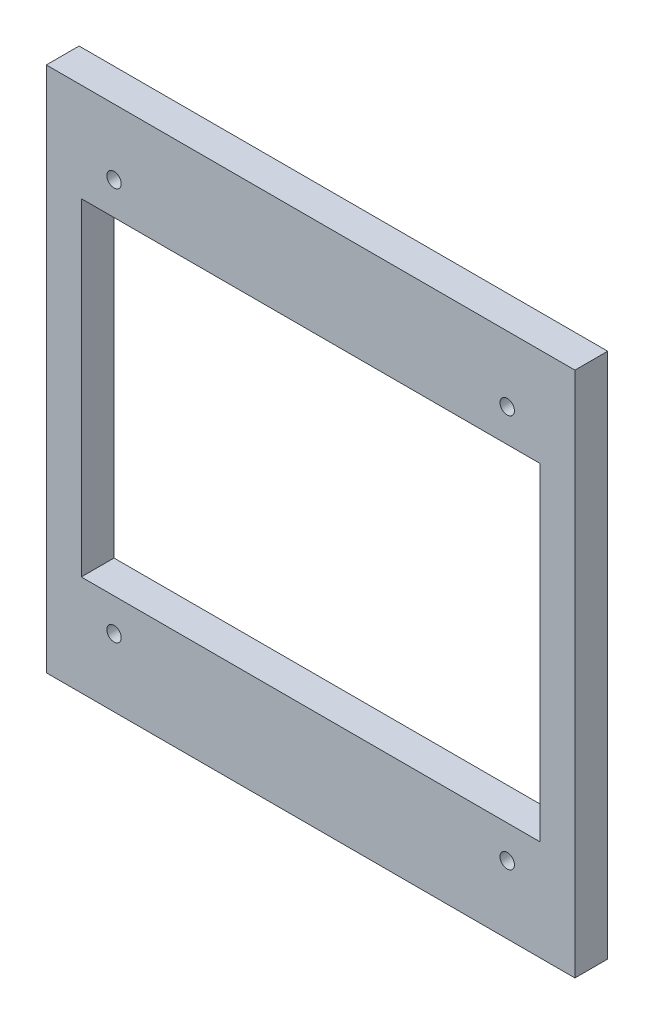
ISO-10303-21;
HEADER;
FILE_DESCRIPTION(('STEP AP214'),'2;1');
FILE_NAME('part.step','',(''),(''),'','','');
FILE_SCHEMA(('AUTOMOTIVE_DESIGN { 1 0 10303 214 1 1 1 1 }'));
ENDSEC;
DATA;
#1=APPLICATION_CONTEXT('core data for automotive mechanical design processes');
#2=APPLICATION_PROTOCOL_DEFINITION('international standard','automotive_design',2000,#1);
#3=PRODUCT_CONTEXT('',#1,'mechanical');
#4=PRODUCT('Part','Part','',(#3));
#5=PRODUCT_RELATED_PRODUCT_CATEGORY('part','',(#4));
#6=PRODUCT_DEFINITION_FORMATION('','',#4);
#7=PRODUCT_DEFINITION_CONTEXT('part definition',#1,'design');
#8=PRODUCT_DEFINITION('design','',#6,#7);
#9=PRODUCT_DEFINITION_SHAPE('','',#8);
#10=(LENGTH_UNIT() NAMED_UNIT(*) SI_UNIT(.MILLI.,.METRE.));
#11=(NAMED_UNIT(*) PLANE_ANGLE_UNIT() SI_UNIT($,.RADIAN.));
#12=(NAMED_UNIT(*) SI_UNIT($,.STERADIAN.) SOLID_ANGLE_UNIT());
#13=UNCERTAINTY_MEASURE_WITH_UNIT(LENGTH_MEASURE(1.E-05),#10,'distance_accuracy_value','');
#14=(GEOMETRIC_REPRESENTATION_CONTEXT(3) GLOBAL_UNCERTAINTY_ASSIGNED_CONTEXT((#13)) GLOBAL_UNIT_ASSIGNED_CONTEXT((#10,
#11,#12)) REPRESENTATION_CONTEXT('',''));
#15=CARTESIAN_POINT('',(0.,0.,0.));
#16=DIRECTION('',(0.,0.,1.));
#17=DIRECTION('',(1.,0.,0.));
#18=AXIS2_PLACEMENT_3D('',#15,#16,#17);
#19=CARTESIAN_POINT('',(-2.53999999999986,609.599999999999,38.1));
#20=DIRECTION('',(0.,0.,-1.));
#21=DIRECTION('',(-1.,0.,0.));
#22=AXIS2_PLACEMENT_3D('',#19,#20,#21);
#23=PLANE('',#22);
#24=CARTESIAN_POINT('',(533.4,533.4,38.1));
#25=DIRECTION('',(0.,0.,-1.));
#26=DIRECTION('',(-1.,0.,0.));
#27=AXIS2_PLACEMENT_3D('',#24,#25,#26);
#28=CIRCLE('',#27,8.38199999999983);
#29=CARTESIAN_POINT('',(525.018,533.4,38.1));
#30=VERTEX_POINT('',#29);
#31=EDGE_CURVE('E241',#30,#30,#28,.T.);
#32=ORIENTED_EDGE('',*,*,#31,.T.);
#33=EDGE_LOOP('',(#32));
#34=FACE_BOUND('',#33,.T.);
#35=CARTESIAN_POINT('',(76.1999999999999,533.4,38.1));
#36=DIRECTION('',(0.,0.,-1.));
#37=DIRECTION('',(-1.,0.,0.));
#38=AXIS2_PLACEMENT_3D('',#35,#36,#37);
#39=CIRCLE('',#38,8.38199999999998);
#40=CARTESIAN_POINT('',(67.8179999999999,533.4,38.1));
#41=VERTEX_POINT('',#40);
#42=EDGE_CURVE('E251',#41,#41,#39,.T.);
#43=ORIENTED_EDGE('',*,*,#42,.T.);
#44=EDGE_LOOP('',(#43));
#45=FACE_BOUND('',#44,.T.);
#46=CARTESIAN_POINT('',(533.4,76.2,38.1));
#47=DIRECTION('',(0.,0.,-1.));
#48=DIRECTION('',(-1.,0.,0.));
#49=AXIS2_PLACEMENT_3D('',#46,#47,#48);
#50=CIRCLE('',#49,8.38199999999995);
#51=CARTESIAN_POINT('',(525.018,76.2,38.1));
#52=VERTEX_POINT('',#51);
#53=EDGE_CURVE('E259',#52,#52,#50,.T.);
#54=ORIENTED_EDGE('',*,*,#53,.T.);
#55=EDGE_LOOP('',(#54));
#56=FACE_BOUND('',#55,.T.);
#57=CARTESIAN_POINT('',(76.2000000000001,76.2,38.1));
#58=DIRECTION('',(0.,0.,-1.));
#59=DIRECTION('',(-1.,0.,0.));
#60=AXIS2_PLACEMENT_3D('',#57,#58,#59);
#61=CIRCLE('',#60,8.382);
#62=CARTESIAN_POINT('',(67.8180000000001,76.2,38.1));
#63=VERTEX_POINT('',#62);
#64=EDGE_CURVE('E138',#63,#63,#61,.T.);
#65=ORIENTED_EDGE('',*,*,#64,.T.);
#66=EDGE_LOOP('',(#65));
#67=FACE_BOUND('',#66,.T.);
#68=DIRECTION('',(0.,-1.,0.));
#69=VECTOR('',#68,1.);
#70=CARTESIAN_POINT('',(-2.53999999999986,-2.54,38.1));
#71=LINE('',#70,#69);
#72=CARTESIAN_POINT('',(-2.53999999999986,609.599999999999,38.1));
#73=VERTEX_POINT('',#72);
#74=CARTESIAN_POINT('',(-2.53999999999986,-2.54,38.1));
#75=VERTEX_POINT('',#74);
#76=EDGE_CURVE('E148',#73,#75,#71,.T.);
#77=ORIENTED_EDGE('',*,*,#76,.T.);
#78=DIRECTION('',(1.,0.,0.));
#79=VECTOR('',#78,1.);
#80=CARTESIAN_POINT('',(-2.53999999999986,-2.54,38.1));
#81=LINE('',#80,#79);
#82=CARTESIAN_POINT('',(612.14,-2.54,38.1));
#83=VERTEX_POINT('',#82);
#84=EDGE_CURVE('E149',#75,#83,#81,.T.);
#85=ORIENTED_EDGE('',*,*,#84,.T.);
#86=DIRECTION('',(0.,1.,0.));
#87=VECTOR('',#86,1.);
#88=CARTESIAN_POINT('',(612.14,-2.54,38.1));
#89=LINE('',#88,#87);
#90=CARTESIAN_POINT('',(612.14,609.599999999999,38.1));
#91=VERTEX_POINT('',#90);
#92=EDGE_CURVE('E155',#83,#91,#89,.T.);
#93=ORIENTED_EDGE('',*,*,#92,.T.);
#94=DIRECTION('',(-1.,0.,0.));
#95=VECTOR('',#94,1.);
#96=CARTESIAN_POINT('',(-2.53999999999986,609.599999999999,38.1));
#97=LINE('',#96,#95);
#98=EDGE_CURVE('E152',#91,#73,#97,.T.);
#99=ORIENTED_EDGE('',*,*,#98,.T.);
#100=EDGE_LOOP('',(#77,#85,#93,#99));
#101=FACE_BOUND('',#100,.T.);
#102=DIRECTION('',(0.,1.,0.));
#103=VECTOR('',#102,1.);
#104=CARTESIAN_POINT('',(571.5,495.3,38.1));
#105=LINE('',#104,#103);
#106=CARTESIAN_POINT('',(571.5,114.3,38.1));
#107=VERTEX_POINT('',#106);
#108=CARTESIAN_POINT('',(571.5,495.3,38.1));
#109=VERTEX_POINT('',#108);
#110=EDGE_CURVE('E107',#107,#109,#105,.T.);
#111=ORIENTED_EDGE('',*,*,#110,.F.);
#112=DIRECTION('',(1.,0.,0.));
#113=VECTOR('',#112,1.);
#114=CARTESIAN_POINT('',(571.5,114.3,38.1));
#115=LINE('',#114,#113);
#116=CARTESIAN_POINT('',(38.1000000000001,114.3,38.1));
#117=VERTEX_POINT('',#116);
#118=EDGE_CURVE('E128',#117,#107,#115,.T.);
#119=ORIENTED_EDGE('',*,*,#118,.F.);
#120=DIRECTION('',(0.,-1.,0.));
#121=VECTOR('',#120,1.);
#122=CARTESIAN_POINT('',(38.1000000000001,495.3,38.1));
#123=LINE('',#122,#121);
#124=CARTESIAN_POINT('',(38.1000000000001,495.3,38.1));
#125=VERTEX_POINT('',#124);
#126=EDGE_CURVE('E126',#125,#117,#123,.T.);
#127=ORIENTED_EDGE('',*,*,#126,.F.);
#128=DIRECTION('',(-1.,0.,0.));
#129=VECTOR('',#128,1.);
#130=CARTESIAN_POINT('',(571.5,495.3,38.1));
#131=LINE('',#130,#129);
#132=EDGE_CURVE('E118',#109,#125,#131,.T.);
#133=ORIENTED_EDGE('',*,*,#132,.F.);
#134=EDGE_LOOP('',(#111,#119,#127,#133));
#135=FACE_BOUND('',#134,.T.);
#136=ADVANCED_FACE('F43',(#34,#45,#56,#67,#101,#135),#23,.F.);
#137=CARTESIAN_POINT('',(-2.53999999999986,609.599999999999,0.));
#138=DIRECTION('',(0.,0.,-1.));
#139=DIRECTION('',(-1.,0.,0.));
#140=AXIS2_PLACEMENT_3D('',#137,#138,#139);
#141=PLANE('',#140);
#142=CARTESIAN_POINT('',(533.4,533.4,0.));
#143=DIRECTION('',(0.,0.,-1.));
#144=DIRECTION('',(-1.,0.,0.));
#145=AXIS2_PLACEMENT_3D('',#142,#143,#144);
#146=CIRCLE('',#145,8.38199999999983);
#147=CARTESIAN_POINT('',(525.018,533.4,0.));
#148=VERTEX_POINT('',#147);
#149=EDGE_CURVE('E246',#148,#148,#146,.T.);
#150=ORIENTED_EDGE('',*,*,#149,.F.);
#151=EDGE_LOOP('',(#150));
#152=FACE_BOUND('',#151,.T.);
#153=CARTESIAN_POINT('',(76.1999999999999,533.4,0.));
#154=DIRECTION('',(0.,0.,-1.));
#155=DIRECTION('',(-1.,0.,0.));
#156=AXIS2_PLACEMENT_3D('',#153,#154,#155);
#157=CIRCLE('',#156,8.38199999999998);
#158=CARTESIAN_POINT('',(67.8179999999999,533.4,0.));
#159=VERTEX_POINT('',#158);
#160=EDGE_CURVE('E247',#159,#159,#157,.T.);
#161=ORIENTED_EDGE('',*,*,#160,.F.);
#162=EDGE_LOOP('',(#161));
#163=FACE_BOUND('',#162,.T.);
#164=CARTESIAN_POINT('',(533.4,76.2,0.));
#165=DIRECTION('',(0.,0.,-1.));
#166=DIRECTION('',(-1.,0.,0.));
#167=AXIS2_PLACEMENT_3D('',#164,#165,#166);
#168=CIRCLE('',#167,8.38199999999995);
#169=CARTESIAN_POINT('',(525.018,76.2,0.));
#170=VERTEX_POINT('',#169);
#171=EDGE_CURVE('E258',#170,#170,#168,.T.);
#172=ORIENTED_EDGE('',*,*,#171,.F.);
#173=EDGE_LOOP('',(#172));
#174=FACE_BOUND('',#173,.T.);
#175=CARTESIAN_POINT('',(76.2000000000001,76.2,0.));
#176=DIRECTION('',(0.,0.,-1.));
#177=DIRECTION('',(-1.,0.,0.));
#178=AXIS2_PLACEMENT_3D('',#175,#176,#177);
#179=CIRCLE('',#178,8.382);
#180=CARTESIAN_POINT('',(67.8180000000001,76.2,0.));
#181=VERTEX_POINT('',#180);
#182=EDGE_CURVE('E265',#181,#181,#179,.T.);
#183=ORIENTED_EDGE('',*,*,#182,.F.);
#184=EDGE_LOOP('',(#183));
#185=FACE_BOUND('',#184,.T.);
#186=DIRECTION('',(0.,-1.,0.));
#187=VECTOR('',#186,1.);
#188=CARTESIAN_POINT('',(-2.53999999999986,-2.54,0.));
#189=LINE('',#188,#187);
#190=CARTESIAN_POINT('',(-2.53999999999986,609.599999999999,0.));
#191=VERTEX_POINT('',#190);
#192=CARTESIAN_POINT('',(-2.53999999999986,-2.54,0.));
#193=VERTEX_POINT('',#192);
#194=EDGE_CURVE('E122',#191,#193,#189,.T.);
#195=ORIENTED_EDGE('',*,*,#194,.F.);
#196=DIRECTION('',(-1.,0.,0.));
#197=VECTOR('',#196,1.);
#198=CARTESIAN_POINT('',(-2.53999999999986,609.599999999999,0.));
#199=LINE('',#198,#197);
#200=CARTESIAN_POINT('',(612.14,609.599999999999,0.));
#201=VERTEX_POINT('',#200);
#202=EDGE_CURVE('E147',#201,#191,#199,.T.);
#203=ORIENTED_EDGE('',*,*,#202,.F.);
#204=DIRECTION('',(0.,1.,0.));
#205=VECTOR('',#204,1.);
#206=CARTESIAN_POINT('',(612.14,-2.54,0.));
#207=LINE('',#206,#205);
#208=CARTESIAN_POINT('',(612.14,-2.54,0.));
#209=VERTEX_POINT('',#208);
#210=EDGE_CURVE('E161',#209,#201,#207,.T.);
#211=ORIENTED_EDGE('',*,*,#210,.F.);
#212=DIRECTION('',(1.,0.,0.));
#213=VECTOR('',#212,1.);
#214=CARTESIAN_POINT('',(-2.53999999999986,-2.54,0.));
#215=LINE('',#214,#213);
#216=EDGE_CURVE('E157',#193,#209,#215,.T.);
#217=ORIENTED_EDGE('',*,*,#216,.F.);
#218=EDGE_LOOP('',(#195,#203,#211,#217));
#219=FACE_BOUND('',#218,.T.);
#220=DIRECTION('',(1.,0.,0.));
#221=VECTOR('',#220,1.);
#222=CARTESIAN_POINT('',(571.5,114.3,0.));
#223=LINE('',#222,#221);
#224=CARTESIAN_POINT('',(38.1000000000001,114.3,0.));
#225=VERTEX_POINT('',#224);
#226=CARTESIAN_POINT('',(571.5,114.3,0.));
#227=VERTEX_POINT('',#226);
#228=EDGE_CURVE('E120',#225,#227,#223,.T.);
#229=ORIENTED_EDGE('',*,*,#228,.T.);
#230=DIRECTION('',(0.,1.,0.));
#231=VECTOR('',#230,1.);
#232=CARTESIAN_POINT('',(571.5,495.3,0.));
#233=LINE('',#232,#231);
#234=CARTESIAN_POINT('',(571.5,495.3,0.));
#235=VERTEX_POINT('',#234);
#236=EDGE_CURVE('E66',#227,#235,#233,.T.);
#237=ORIENTED_EDGE('',*,*,#236,.T.);
#238=DIRECTION('',(-1.,0.,0.));
#239=VECTOR('',#238,1.);
#240=CARTESIAN_POINT('',(571.5,495.3,0.));
#241=LINE('',#240,#239);
#242=CARTESIAN_POINT('',(38.1000000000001,495.3,0.));
#243=VERTEX_POINT('',#242);
#244=EDGE_CURVE('E123',#235,#243,#241,.T.);
#245=ORIENTED_EDGE('',*,*,#244,.T.);
#246=DIRECTION('',(0.,-1.,0.));
#247=VECTOR('',#246,1.);
#248=CARTESIAN_POINT('',(38.1000000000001,495.3,0.));
#249=LINE('',#248,#247);
#250=EDGE_CURVE('E136',#243,#225,#249,.T.);
#251=ORIENTED_EDGE('',*,*,#250,.T.);
#252=EDGE_LOOP('',(#229,#237,#245,#251));
#253=FACE_BOUND('',#252,.T.);
#254=ADVANCED_FACE('F177',(#152,#163,#174,#185,#219,#253),#141,.T.);
#255=CARTESIAN_POINT('',(-2.53999999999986,-2.54,38.1));
#256=DIRECTION('',(1.,0.,0.));
#257=DIRECTION('',(0.,0.,-1.));
#258=AXIS2_PLACEMENT_3D('',#255,#256,#257);
#259=PLANE('',#258);
#260=ORIENTED_EDGE('',*,*,#194,.T.);
#261=DIRECTION('',(0.,0.,-1.));
#262=VECTOR('',#261,1.);
#263=CARTESIAN_POINT('',(-2.53999999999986,-2.54,38.1));
#264=LINE('',#263,#262);
#265=EDGE_CURVE('E11',#75,#193,#264,.T.);
#266=ORIENTED_EDGE('',*,*,#265,.F.);
#267=ORIENTED_EDGE('',*,*,#76,.F.);
#268=DIRECTION('',(0.,0.,-1.));
#269=VECTOR('',#268,1.);
#270=CARTESIAN_POINT('',(-2.53999999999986,609.599999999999,38.1));
#271=LINE('',#270,#269);
#272=EDGE_CURVE('E156',#73,#191,#271,.T.);
#273=ORIENTED_EDGE('',*,*,#272,.T.);
#274=EDGE_LOOP('',(#260,#266,#267,#273));
#275=FACE_BOUND('',#274,.T.);
#276=ADVANCED_FACE('F44',(#275),#259,.F.);
#277=CARTESIAN_POINT('',(-2.53999999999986,-2.54,38.1));
#278=DIRECTION('',(0.,1.,0.));
#279=DIRECTION('',(0.,0.,1.));
#280=AXIS2_PLACEMENT_3D('',#277,#278,#279);
#281=PLANE('',#280);
#282=ORIENTED_EDGE('',*,*,#216,.T.);
#283=DIRECTION('',(0.,0.,-1.));
#284=VECTOR('',#283,1.);
#285=CARTESIAN_POINT('',(612.14,-2.54,38.1));
#286=LINE('',#285,#284);
#287=EDGE_CURVE('E51',#83,#209,#286,.T.);
#288=ORIENTED_EDGE('',*,*,#287,.F.);
#289=ORIENTED_EDGE('',*,*,#84,.F.);
#290=ORIENTED_EDGE('',*,*,#265,.T.);
#291=EDGE_LOOP('',(#282,#288,#289,#290));
#292=FACE_BOUND('',#291,.T.);
#293=ADVANCED_FACE('F190',(#292),#281,.F.);
#294=CARTESIAN_POINT('',(612.14,-2.54,38.1));
#295=DIRECTION('',(-1.,0.,0.));
#296=DIRECTION('',(0.,0.,1.));
#297=AXIS2_PLACEMENT_3D('',#294,#295,#296);
#298=PLANE('',#297);
#299=ORIENTED_EDGE('',*,*,#210,.T.);
#300=DIRECTION('',(0.,0.,-1.));
#301=VECTOR('',#300,1.);
#302=CARTESIAN_POINT('',(612.14,609.599999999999,38.1));
#303=LINE('',#302,#301);
#304=EDGE_CURVE('E167',#91,#201,#303,.T.);
#305=ORIENTED_EDGE('',*,*,#304,.F.);
#306=ORIENTED_EDGE('',*,*,#92,.F.);
#307=ORIENTED_EDGE('',*,*,#287,.T.);
#308=EDGE_LOOP('',(#299,#305,#306,#307));
#309=FACE_BOUND('',#308,.T.);
#310=ADVANCED_FACE('F171',(#309),#298,.F.);
#311=CARTESIAN_POINT('',(-2.53999999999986,609.599999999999,38.1));
#312=DIRECTION('',(0.,-1.,0.));
#313=DIRECTION('',(0.,0.,-1.));
#314=AXIS2_PLACEMENT_3D('',#311,#312,#313);
#315=PLANE('',#314);
#316=ORIENTED_EDGE('',*,*,#202,.T.);
#317=ORIENTED_EDGE('',*,*,#272,.F.);
#318=ORIENTED_EDGE('',*,*,#98,.F.);
#319=ORIENTED_EDGE('',*,*,#304,.T.);
#320=EDGE_LOOP('',(#316,#317,#318,#319));
#321=FACE_BOUND('',#320,.T.);
#322=ADVANCED_FACE('F181',(#321),#315,.F.);
#323=CARTESIAN_POINT('',(571.5,495.3,38.1));
#324=DIRECTION('',(-1.,0.,0.));
#325=DIRECTION('',(0.,0.,1.));
#326=AXIS2_PLACEMENT_3D('',#323,#324,#325);
#327=PLANE('',#326);
#328=ORIENTED_EDGE('',*,*,#236,.F.);
#329=DIRECTION('',(0.,0.,-1.));
#330=VECTOR('',#329,1.);
#331=CARTESIAN_POINT('',(571.5,114.3,38.1));
#332=LINE('',#331,#330);
#333=EDGE_CURVE('E115',#107,#227,#332,.T.);
#334=ORIENTED_EDGE('',*,*,#333,.F.);
#335=ORIENTED_EDGE('',*,*,#110,.T.);
#336=DIRECTION('',(0.,0.,-1.));
#337=VECTOR('',#336,1.);
#338=CARTESIAN_POINT('',(571.5,495.3,38.1));
#339=LINE('',#338,#337);
#340=EDGE_CURVE('E112',#109,#235,#339,.T.);
#341=ORIENTED_EDGE('',*,*,#340,.T.);
#342=EDGE_LOOP('',(#328,#334,#335,#341));
#343=FACE_BOUND('',#342,.T.);
#344=ADVANCED_FACE('F109',(#343),#327,.T.);
#345=CARTESIAN_POINT('',(571.5,495.3,38.1));
#346=DIRECTION('',(0.,-1.,0.));
#347=DIRECTION('',(0.,0.,-1.));
#348=AXIS2_PLACEMENT_3D('',#345,#346,#347);
#349=PLANE('',#348);
#350=ORIENTED_EDGE('',*,*,#244,.F.);
#351=ORIENTED_EDGE('',*,*,#340,.F.);
#352=ORIENTED_EDGE('',*,*,#132,.T.);
#353=DIRECTION('',(0.,0.,-1.));
#354=VECTOR('',#353,1.);
#355=CARTESIAN_POINT('',(38.1000000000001,495.3,38.1));
#356=LINE('',#355,#354);
#357=EDGE_CURVE('E124',#125,#243,#356,.T.);
#358=ORIENTED_EDGE('',*,*,#357,.T.);
#359=EDGE_LOOP('',(#350,#351,#352,#358));
#360=FACE_BOUND('',#359,.T.);
#361=ADVANCED_FACE('F117',(#360),#349,.T.);
#362=CARTESIAN_POINT('',(38.1000000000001,495.3,38.1));
#363=DIRECTION('',(1.,0.,0.));
#364=DIRECTION('',(0.,0.,-1.));
#365=AXIS2_PLACEMENT_3D('',#362,#363,#364);
#366=PLANE('',#365);
#367=ORIENTED_EDGE('',*,*,#250,.F.);
#368=ORIENTED_EDGE('',*,*,#357,.F.);
#369=ORIENTED_EDGE('',*,*,#126,.T.);
#370=DIRECTION('',(0.,0.,-1.));
#371=VECTOR('',#370,1.);
#372=CARTESIAN_POINT('',(38.1000000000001,114.3,38.1));
#373=LINE('',#372,#371);
#374=EDGE_CURVE('E59',#117,#225,#373,.T.);
#375=ORIENTED_EDGE('',*,*,#374,.T.);
#376=EDGE_LOOP('',(#367,#368,#369,#375));
#377=FACE_BOUND('',#376,.T.);
#378=ADVANCED_FACE('F220',(#377),#366,.T.);
#379=CARTESIAN_POINT('',(571.5,114.3,38.1));
#380=DIRECTION('',(0.,1.,0.));
#381=DIRECTION('',(0.,0.,1.));
#382=AXIS2_PLACEMENT_3D('',#379,#380,#381);
#383=PLANE('',#382);
#384=ORIENTED_EDGE('',*,*,#228,.F.);
#385=ORIENTED_EDGE('',*,*,#374,.F.);
#386=ORIENTED_EDGE('',*,*,#118,.T.);
#387=ORIENTED_EDGE('',*,*,#333,.T.);
#388=EDGE_LOOP('',(#384,#385,#386,#387));
#389=FACE_BOUND('',#388,.T.);
#390=ADVANCED_FACE('F222',(#389),#383,.T.);
#391=CARTESIAN_POINT('',(76.2000000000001,76.2,38.1));
#392=DIRECTION('',(0.,0.,-1.));
#393=DIRECTION('',(-1.,0.,0.));
#394=AXIS2_PLACEMENT_3D('',#391,#392,#393);
#395=CYLINDRICAL_SURFACE('',#394,8.382);
#396=CARTESIAN_POINT('',(67.8180000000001,76.2,38.1));
#397=CARTESIAN_POINT('',(67.8180000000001,76.2,37.703125));
#398=CARTESIAN_POINT('',(67.8180000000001,76.2,37.30625));
#399=CARTESIAN_POINT('',(67.8180000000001,76.2,36.5125));
#400=CARTESIAN_POINT('',(67.8180000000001,76.2,36.115625));
#401=CARTESIAN_POINT('',(67.8180000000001,76.2,35.321875));
#402=CARTESIAN_POINT('',(67.8180000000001,76.2,34.925));
#403=CARTESIAN_POINT('',(67.8180000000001,76.2,34.13125));
#404=CARTESIAN_POINT('',(67.8180000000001,76.2,33.734375));
#405=CARTESIAN_POINT('',(67.8180000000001,76.2,32.940625));
#406=CARTESIAN_POINT('',(67.8180000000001,76.2,32.54375));
#407=CARTESIAN_POINT('',(67.8180000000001,76.2,31.75));
#408=CARTESIAN_POINT('',(67.8180000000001,76.2,31.353125));
#409=CARTESIAN_POINT('',(67.8180000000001,76.2,30.559375));
#410=CARTESIAN_POINT('',(67.8180000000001,76.2,30.1625));
#411=CARTESIAN_POINT('',(67.8180000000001,76.2,29.36875));
#412=CARTESIAN_POINT('',(67.8180000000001,76.2,28.971875));
#413=CARTESIAN_POINT('',(67.8180000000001,76.2,28.178125));
#414=CARTESIAN_POINT('',(67.8180000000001,76.2,27.78125));
#415=CARTESIAN_POINT('',(67.8180000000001,76.2,26.9875));
#416=CARTESIAN_POINT('',(67.8180000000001,76.2,26.590625));
#417=CARTESIAN_POINT('',(67.8180000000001,76.2,25.796875));
#418=CARTESIAN_POINT('',(67.8180000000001,76.2,25.4));
#419=CARTESIAN_POINT('',(67.8180000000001,76.2,24.60625));
#420=CARTESIAN_POINT('',(67.8180000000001,76.2,24.209375));
#421=CARTESIAN_POINT('',(67.8180000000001,76.2,23.415625));
#422=CARTESIAN_POINT('',(67.8180000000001,76.2,23.01875));
#423=CARTESIAN_POINT('',(67.8180000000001,76.2,22.225));
#424=CARTESIAN_POINT('',(67.8180000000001,76.2,21.828125));
#425=CARTESIAN_POINT('',(67.8180000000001,76.2,21.034375));
#426=CARTESIAN_POINT('',(67.8180000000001,76.2,20.6375));
#427=CARTESIAN_POINT('',(67.8180000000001,76.2,19.84375));
#428=CARTESIAN_POINT('',(67.8180000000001,76.2,19.446875));
#429=CARTESIAN_POINT('',(67.8180000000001,76.2,18.653125));
#430=CARTESIAN_POINT('',(67.8180000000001,76.2,18.25625));
#431=CARTESIAN_POINT('',(67.8180000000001,76.2,17.4625));
#432=CARTESIAN_POINT('',(67.8180000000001,76.2,17.065625));
#433=CARTESIAN_POINT('',(67.8180000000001,76.2,16.271875));
#434=CARTESIAN_POINT('',(67.8180000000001,76.2,15.875));
#435=CARTESIAN_POINT('',(67.8180000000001,76.2,15.08125));
#436=CARTESIAN_POINT('',(67.8180000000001,76.2,14.684375));
#437=CARTESIAN_POINT('',(67.8180000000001,76.2,13.890625));
#438=CARTESIAN_POINT('',(67.8180000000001,76.2,13.49375));
#439=CARTESIAN_POINT('',(67.8180000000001,76.2,12.7));
#440=CARTESIAN_POINT('',(67.8180000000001,76.2,12.303125));
#441=CARTESIAN_POINT('',(67.8180000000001,76.2,11.509375));
#442=CARTESIAN_POINT('',(67.8180000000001,76.2,11.1125));
#443=CARTESIAN_POINT('',(67.8180000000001,76.2,10.31875));
#444=CARTESIAN_POINT('',(67.8180000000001,76.2,9.921875));
#445=CARTESIAN_POINT('',(67.8180000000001,76.2,9.128125));
#446=CARTESIAN_POINT('',(67.8180000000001,76.2,8.73125));
#447=CARTESIAN_POINT('',(67.8180000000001,76.2,7.9375));
#448=CARTESIAN_POINT('',(67.8180000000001,76.2,7.540625));
#449=CARTESIAN_POINT('',(67.8180000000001,76.2,6.746875));
#450=CARTESIAN_POINT('',(67.8180000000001,76.2,6.35));
#451=CARTESIAN_POINT('',(67.8180000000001,76.2,5.55625));
#452=CARTESIAN_POINT('',(67.8180000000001,76.2,5.159375));
#453=CARTESIAN_POINT('',(67.8180000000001,76.2,4.365625));
#454=CARTESIAN_POINT('',(67.8180000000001,76.2,3.96875));
#455=CARTESIAN_POINT('',(67.8180000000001,76.2,3.175));
#456=CARTESIAN_POINT('',(67.8180000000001,76.2,2.778125));
#457=CARTESIAN_POINT('',(67.8180000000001,76.2,1.984375));
#458=CARTESIAN_POINT('',(67.8180000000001,76.2,1.5875));
#459=CARTESIAN_POINT('',(67.8180000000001,76.2,0.79375));
#460=CARTESIAN_POINT('',(67.8180000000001,76.2,0.396875));
#461=CARTESIAN_POINT('',(67.8180000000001,76.2,0.));
#462=B_SPLINE_CURVE_WITH_KNOTS('',3,(#396,#397,#398,#399,#400,#401,#402,#403,#404,#405,#406,
#407,#408,#409,#410,#411,#412,#413,#414,#415,#416,#417,#418,#419,#420,#421,#422,#423,#424,#425,
#426,#427,#428,#429,#430,#431,#432,#433,#434,#435,#436,#437,#438,#439,#440,#441,#442,#443,#444,
#445,#446,#447,#448,#449,#450,#451,#452,#453,#454,#455,#456,#457,#458,#459,#460,#461),
.UNSPECIFIED.,.F.,.F.,(4,2,2,2,2,2,2,2,2,2,2,2,2,2,2,2,2,2,2,2,2,2,2,2,2,2,2,2,2,2,2,2,4),(0.,
1.190625,2.38125,3.571875,4.7625,5.953125,7.14375,8.334375,9.52500000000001,10.715625,11.90625,
13.096875,14.2875,15.478125,16.66875,17.859375,19.05,20.240625,21.43125,22.621875,23.8125,
25.003125,26.19375,27.384375,28.575,29.765625,30.95625,32.146875,33.3375,34.528125,35.71875,
36.909375,38.1),.UNSPECIFIED.);
#463=EDGE_CURVE('BSEAM228',#63,#181,#462,.T.);
#464=ORIENTED_EDGE('',*,*,#64,.F.);
#465=ORIENTED_EDGE('',*,*,#182,.T.);
#466=ORIENTED_EDGE('',*,*,#463,.T.);
#467=ORIENTED_EDGE('',*,*,#463,.F.);
#468=EDGE_LOOP('',(#464,#466,#465,#467));
#469=FACE_BOUND('',#468,.T.);
#470=ADVANCED_FACE('F228',(#469),#395,.F.);
#471=CARTESIAN_POINT('',(533.4,76.2,38.1));
#472=DIRECTION('',(0.,0.,-1.));
#473=DIRECTION('',(-1.,0.,0.));
#474=AXIS2_PLACEMENT_3D('',#471,#472,#473);
#475=CYLINDRICAL_SURFACE('',#474,8.38199999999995);
#476=CARTESIAN_POINT('',(525.018,76.2,38.1));
#477=CARTESIAN_POINT('',(525.018,76.2,37.703125));
#478=CARTESIAN_POINT('',(525.018,76.2,37.30625));
#479=CARTESIAN_POINT('',(525.018,76.2,36.5125));
#480=CARTESIAN_POINT('',(525.018,76.2,36.115625));
#481=CARTESIAN_POINT('',(525.018,76.2,35.321875));
#482=CARTESIAN_POINT('',(525.018,76.2,34.925));
#483=CARTESIAN_POINT('',(525.018,76.2,34.13125));
#484=CARTESIAN_POINT('',(525.018,76.2,33.734375));
#485=CARTESIAN_POINT('',(525.018,76.2,32.940625));
#486=CARTESIAN_POINT('',(525.018,76.2,32.54375));
#487=CARTESIAN_POINT('',(525.018,76.2,31.75));
#488=CARTESIAN_POINT('',(525.018,76.2,31.353125));
#489=CARTESIAN_POINT('',(525.018,76.2,30.559375));
#490=CARTESIAN_POINT('',(525.018,76.2,30.1625));
#491=CARTESIAN_POINT('',(525.018,76.2,29.36875));
#492=CARTESIAN_POINT('',(525.018,76.2,28.971875));
#493=CARTESIAN_POINT('',(525.018,76.2,28.178125));
#494=CARTESIAN_POINT('',(525.018,76.2,27.78125));
#495=CARTESIAN_POINT('',(525.018,76.2,26.9875));
#496=CARTESIAN_POINT('',(525.018,76.2,26.590625));
#497=CARTESIAN_POINT('',(525.018,76.2,25.796875));
#498=CARTESIAN_POINT('',(525.018,76.2,25.4));
#499=CARTESIAN_POINT('',(525.018,76.2,24.60625));
#500=CARTESIAN_POINT('',(525.018,76.2,24.209375));
#501=CARTESIAN_POINT('',(525.018,76.2,23.415625));
#502=CARTESIAN_POINT('',(525.018,76.2,23.01875));
#503=CARTESIAN_POINT('',(525.018,76.2,22.225));
#504=CARTESIAN_POINT('',(525.018,76.2,21.828125));
#505=CARTESIAN_POINT('',(525.018,76.2,21.034375));
#506=CARTESIAN_POINT('',(525.018,76.2,20.6375));
#507=CARTESIAN_POINT('',(525.018,76.2,19.84375));
#508=CARTESIAN_POINT('',(525.018,76.2,19.446875));
#509=CARTESIAN_POINT('',(525.018,76.2,18.653125));
#510=CARTESIAN_POINT('',(525.018,76.2,18.25625));
#511=CARTESIAN_POINT('',(525.018,76.2,17.4625));
#512=CARTESIAN_POINT('',(525.018,76.2,17.065625));
#513=CARTESIAN_POINT('',(525.018,76.2,16.271875));
#514=CARTESIAN_POINT('',(525.018,76.2,15.875));
#515=CARTESIAN_POINT('',(525.018,76.2,15.08125));
#516=CARTESIAN_POINT('',(525.018,76.2,14.684375));
#517=CARTESIAN_POINT('',(525.018,76.2,13.890625));
#518=CARTESIAN_POINT('',(525.018,76.2,13.49375));
#519=CARTESIAN_POINT('',(525.018,76.2,12.7));
#520=CARTESIAN_POINT('',(525.018,76.2,12.303125));
#521=CARTESIAN_POINT('',(525.018,76.2,11.509375));
#522=CARTESIAN_POINT('',(525.018,76.2,11.1125));
#523=CARTESIAN_POINT('',(525.018,76.2,10.31875));
#524=CARTESIAN_POINT('',(525.018,76.2,9.921875));
#525=CARTESIAN_POINT('',(525.018,76.2,9.128125));
#526=CARTESIAN_POINT('',(525.018,76.2,8.73125));
#527=CARTESIAN_POINT('',(525.018,76.2,7.9375));
#528=CARTESIAN_POINT('',(525.018,76.2,7.540625));
#529=CARTESIAN_POINT('',(525.018,76.2,6.746875));
#530=CARTESIAN_POINT('',(525.018,76.2,6.35));
#531=CARTESIAN_POINT('',(525.018,76.2,5.55625));
#532=CARTESIAN_POINT('',(525.018,76.2,5.159375));
#533=CARTESIAN_POINT('',(525.018,76.2,4.365625));
#534=CARTESIAN_POINT('',(525.018,76.2,3.96875));
#535=CARTESIAN_POINT('',(525.018,76.2,3.175));
#536=CARTESIAN_POINT('',(525.018,76.2,2.778125));
#537=CARTESIAN_POINT('',(525.018,76.2,1.984375));
#538=CARTESIAN_POINT('',(525.018,76.2,1.5875));
#539=CARTESIAN_POINT('',(525.018,76.2,0.79375));
#540=CARTESIAN_POINT('',(525.018,76.2,0.396875));
#541=CARTESIAN_POINT('',(525.018,76.2,0.));
#542=B_SPLINE_CURVE_WITH_KNOTS('',3,(#476,#477,#478,#479,#480,#481,#482,#483,#484,#485,#486,
#487,#488,#489,#490,#491,#492,#493,#494,#495,#496,#497,#498,#499,#500,#501,#502,#503,#504,#505,
#506,#507,#508,#509,#510,#511,#512,#513,#514,#515,#516,#517,#518,#519,#520,#521,#522,#523,#524,
#525,#526,#527,#528,#529,#530,#531,#532,#533,#534,#535,#536,#537,#538,#539,#540,#541),
.UNSPECIFIED.,.F.,.F.,(4,2,2,2,2,2,2,2,2,2,2,2,2,2,2,2,2,2,2,2,2,2,2,2,2,2,2,2,2,2,2,2,4),(0.,
1.190625,2.38125,3.571875,4.7625,5.953125,7.14375,8.334375,9.52500000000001,10.715625,11.90625,
13.096875,14.2875,15.478125,16.66875,17.859375,19.05,20.240625,21.43125,22.621875,23.8125,
25.003125,26.19375,27.384375,28.575,29.765625,30.95625,32.146875,33.3375,34.528125,35.71875,
36.909375,38.1),.UNSPECIFIED.);
#543=EDGE_CURVE('BSEAM229',#52,#170,#542,.T.);
#544=ORIENTED_EDGE('',*,*,#53,.F.);
#545=ORIENTED_EDGE('',*,*,#171,.T.);
#546=ORIENTED_EDGE('',*,*,#543,.T.);
#547=ORIENTED_EDGE('',*,*,#543,.F.);
#548=EDGE_LOOP('',(#544,#546,#545,#547));
#549=FACE_BOUND('',#548,.T.);
#550=ADVANCED_FACE('F229',(#549),#475,.F.);
#551=CARTESIAN_POINT('',(76.1999999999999,533.4,38.1));
#552=DIRECTION('',(0.,0.,-1.));
#553=DIRECTION('',(-1.,0.,0.));
#554=AXIS2_PLACEMENT_3D('',#551,#552,#553);
#555=CYLINDRICAL_SURFACE('',#554,8.38199999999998);
#556=CARTESIAN_POINT('',(67.8179999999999,533.4,38.1));
#557=CARTESIAN_POINT('',(67.8179999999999,533.4,37.703125));
#558=CARTESIAN_POINT('',(67.8179999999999,533.4,37.30625));
#559=CARTESIAN_POINT('',(67.8179999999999,533.4,36.5125));
#560=CARTESIAN_POINT('',(67.8179999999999,533.4,36.115625));
#561=CARTESIAN_POINT('',(67.8179999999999,533.4,35.321875));
#562=CARTESIAN_POINT('',(67.8179999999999,533.4,34.925));
#563=CARTESIAN_POINT('',(67.8179999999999,533.4,34.13125));
#564=CARTESIAN_POINT('',(67.8179999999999,533.4,33.734375));
#565=CARTESIAN_POINT('',(67.8179999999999,533.4,32.940625));
#566=CARTESIAN_POINT('',(67.8179999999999,533.4,32.54375));
#567=CARTESIAN_POINT('',(67.8179999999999,533.4,31.75));
#568=CARTESIAN_POINT('',(67.8179999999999,533.4,31.353125));
#569=CARTESIAN_POINT('',(67.8179999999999,533.4,30.559375));
#570=CARTESIAN_POINT('',(67.8179999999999,533.4,30.1625));
#571=CARTESIAN_POINT('',(67.8179999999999,533.4,29.36875));
#572=CARTESIAN_POINT('',(67.8179999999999,533.4,28.971875));
#573=CARTESIAN_POINT('',(67.8179999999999,533.4,28.178125));
#574=CARTESIAN_POINT('',(67.8179999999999,533.4,27.78125));
#575=CARTESIAN_POINT('',(67.8179999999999,533.4,26.9875));
#576=CARTESIAN_POINT('',(67.8179999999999,533.4,26.590625));
#577=CARTESIAN_POINT('',(67.8179999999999,533.4,25.796875));
#578=CARTESIAN_POINT('',(67.8179999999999,533.4,25.4));
#579=CARTESIAN_POINT('',(67.8179999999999,533.4,24.60625));
#580=CARTESIAN_POINT('',(67.8179999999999,533.4,24.209375));
#581=CARTESIAN_POINT('',(67.8179999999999,533.4,23.415625));
#582=CARTESIAN_POINT('',(67.8179999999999,533.4,23.01875));
#583=CARTESIAN_POINT('',(67.8179999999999,533.4,22.225));
#584=CARTESIAN_POINT('',(67.8179999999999,533.4,21.828125));
#585=CARTESIAN_POINT('',(67.8179999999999,533.4,21.034375));
#586=CARTESIAN_POINT('',(67.8179999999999,533.4,20.6375));
#587=CARTESIAN_POINT('',(67.8179999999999,533.4,19.84375));
#588=CARTESIAN_POINT('',(67.8179999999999,533.4,19.446875));
#589=CARTESIAN_POINT('',(67.8179999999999,533.4,18.653125));
#590=CARTESIAN_POINT('',(67.8179999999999,533.4,18.25625));
#591=CARTESIAN_POINT('',(67.8179999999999,533.4,17.4625));
#592=CARTESIAN_POINT('',(67.8179999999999,533.4,17.065625));
#593=CARTESIAN_POINT('',(67.8179999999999,533.4,16.271875));
#594=CARTESIAN_POINT('',(67.8179999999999,533.4,15.875));
#595=CARTESIAN_POINT('',(67.8179999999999,533.4,15.08125));
#596=CARTESIAN_POINT('',(67.8179999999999,533.4,14.684375));
#597=CARTESIAN_POINT('',(67.8179999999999,533.4,13.890625));
#598=CARTESIAN_POINT('',(67.8179999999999,533.4,13.49375));
#599=CARTESIAN_POINT('',(67.8179999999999,533.4,12.7));
#600=CARTESIAN_POINT('',(67.8179999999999,533.4,12.303125));
#601=CARTESIAN_POINT('',(67.8179999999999,533.4,11.509375));
#602=CARTESIAN_POINT('',(67.8179999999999,533.4,11.1125));
#603=CARTESIAN_POINT('',(67.8179999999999,533.4,10.31875));
#604=CARTESIAN_POINT('',(67.8179999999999,533.4,9.921875));
#605=CARTESIAN_POINT('',(67.8179999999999,533.4,9.128125));
#606=CARTESIAN_POINT('',(67.8179999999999,533.4,8.73125));
#607=CARTESIAN_POINT('',(67.8179999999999,533.4,7.9375));
#608=CARTESIAN_POINT('',(67.8179999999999,533.4,7.540625));
#609=CARTESIAN_POINT('',(67.8179999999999,533.4,6.746875));
#610=CARTESIAN_POINT('',(67.8179999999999,533.4,6.35));
#611=CARTESIAN_POINT('',(67.8179999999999,533.4,5.55625));
#612=CARTESIAN_POINT('',(67.8179999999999,533.4,5.159375));
#613=CARTESIAN_POINT('',(67.8179999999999,533.4,4.365625));
#614=CARTESIAN_POINT('',(67.8179999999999,533.4,3.96875));
#615=CARTESIAN_POINT('',(67.8179999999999,533.4,3.175));
#616=CARTESIAN_POINT('',(67.8179999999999,533.4,2.778125));
#617=CARTESIAN_POINT('',(67.8179999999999,533.4,1.984375));
#618=CARTESIAN_POINT('',(67.8179999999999,533.4,1.5875));
#619=CARTESIAN_POINT('',(67.8179999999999,533.4,0.79375));
#620=CARTESIAN_POINT('',(67.8179999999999,533.4,0.396875));
#621=CARTESIAN_POINT('',(67.8179999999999,533.4,0.));
#622=B_SPLINE_CURVE_WITH_KNOTS('',3,(#556,#557,#558,#559,#560,#561,#562,#563,#564,#565,#566,
#567,#568,#569,#570,#571,#572,#573,#574,#575,#576,#577,#578,#579,#580,#581,#582,#583,#584,#585,
#586,#587,#588,#589,#590,#591,#592,#593,#594,#595,#596,#597,#598,#599,#600,#601,#602,#603,#604,
#605,#606,#607,#608,#609,#610,#611,#612,#613,#614,#615,#616,#617,#618,#619,#620,#621),
.UNSPECIFIED.,.F.,.F.,(4,2,2,2,2,2,2,2,2,2,2,2,2,2,2,2,2,2,2,2,2,2,2,2,2,2,2,2,2,2,2,2,4),(0.,
1.190625,2.38125,3.571875,4.7625,5.953125,7.14375,8.334375,9.52500000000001,10.715625,11.90625,
13.096875,14.2875,15.478125,16.66875,17.859375,19.05,20.240625,21.43125,22.621875,23.8125,
25.003125,26.19375,27.384375,28.575,29.765625,30.95625,32.146875,33.3375,34.528125,35.71875,
36.909375,38.1),.UNSPECIFIED.);
#623=EDGE_CURVE('BSEAM233',#41,#159,#622,.T.);
#624=ORIENTED_EDGE('',*,*,#42,.F.);
#625=ORIENTED_EDGE('',*,*,#160,.T.);
#626=ORIENTED_EDGE('',*,*,#623,.T.);
#627=ORIENTED_EDGE('',*,*,#623,.F.);
#628=EDGE_LOOP('',(#624,#626,#625,#627));
#629=FACE_BOUND('',#628,.T.);
#630=ADVANCED_FACE('F233',(#629),#555,.F.);
#631=CARTESIAN_POINT('',(533.4,533.4,38.1));
#632=DIRECTION('',(0.,0.,-1.));
#633=DIRECTION('',(-1.,0.,0.));
#634=AXIS2_PLACEMENT_3D('',#631,#632,#633);
#635=CYLINDRICAL_SURFACE('',#634,8.38199999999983);
#636=CARTESIAN_POINT('',(525.018,533.4,38.1));
#637=CARTESIAN_POINT('',(525.018,533.4,37.703125));
#638=CARTESIAN_POINT('',(525.018,533.4,37.30625));
#639=CARTESIAN_POINT('',(525.018,533.4,36.5125));
#640=CARTESIAN_POINT('',(525.018,533.4,36.115625));
#641=CARTESIAN_POINT('',(525.018,533.4,35.321875));
#642=CARTESIAN_POINT('',(525.018,533.4,34.925));
#643=CARTESIAN_POINT('',(525.018,533.4,34.13125));
#644=CARTESIAN_POINT('',(525.018,533.4,33.734375));
#645=CARTESIAN_POINT('',(525.018,533.4,32.940625));
#646=CARTESIAN_POINT('',(525.018,533.4,32.54375));
#647=CARTESIAN_POINT('',(525.018,533.4,31.75));
#648=CARTESIAN_POINT('',(525.018,533.4,31.353125));
#649=CARTESIAN_POINT('',(525.018,533.4,30.559375));
#650=CARTESIAN_POINT('',(525.018,533.4,30.1625));
#651=CARTESIAN_POINT('',(525.018,533.4,29.36875));
#652=CARTESIAN_POINT('',(525.018,533.4,28.971875));
#653=CARTESIAN_POINT('',(525.018,533.4,28.178125));
#654=CARTESIAN_POINT('',(525.018,533.4,27.78125));
#655=CARTESIAN_POINT('',(525.018,533.4,26.9875));
#656=CARTESIAN_POINT('',(525.018,533.4,26.590625));
#657=CARTESIAN_POINT('',(525.018,533.4,25.796875));
#658=CARTESIAN_POINT('',(525.018,533.4,25.4));
#659=CARTESIAN_POINT('',(525.018,533.4,24.60625));
#660=CARTESIAN_POINT('',(525.018,533.4,24.209375));
#661=CARTESIAN_POINT('',(525.018,533.4,23.415625));
#662=CARTESIAN_POINT('',(525.018,533.4,23.01875));
#663=CARTESIAN_POINT('',(525.018,533.4,22.225));
#664=CARTESIAN_POINT('',(525.018,533.4,21.828125));
#665=CARTESIAN_POINT('',(525.018,533.4,21.034375));
#666=CARTESIAN_POINT('',(525.018,533.4,20.6375));
#667=CARTESIAN_POINT('',(525.018,533.4,19.84375));
#668=CARTESIAN_POINT('',(525.018,533.4,19.446875));
#669=CARTESIAN_POINT('',(525.018,533.4,18.653125));
#670=CARTESIAN_POINT('',(525.018,533.4,18.25625));
#671=CARTESIAN_POINT('',(525.018,533.4,17.4625));
#672=CARTESIAN_POINT('',(525.018,533.4,17.065625));
#673=CARTESIAN_POINT('',(525.018,533.4,16.271875));
#674=CARTESIAN_POINT('',(525.018,533.4,15.875));
#675=CARTESIAN_POINT('',(525.018,533.4,15.08125));
#676=CARTESIAN_POINT('',(525.018,533.4,14.684375));
#677=CARTESIAN_POINT('',(525.018,533.4,13.890625));
#678=CARTESIAN_POINT('',(525.018,533.4,13.49375));
#679=CARTESIAN_POINT('',(525.018,533.4,12.7));
#680=CARTESIAN_POINT('',(525.018,533.4,12.303125));
#681=CARTESIAN_POINT('',(525.018,533.4,11.509375));
#682=CARTESIAN_POINT('',(525.018,533.4,11.1125));
#683=CARTESIAN_POINT('',(525.018,533.4,10.31875));
#684=CARTESIAN_POINT('',(525.018,533.4,9.921875));
#685=CARTESIAN_POINT('',(525.018,533.4,9.128125));
#686=CARTESIAN_POINT('',(525.018,533.4,8.73125));
#687=CARTESIAN_POINT('',(525.018,533.4,7.9375));
#688=CARTESIAN_POINT('',(525.018,533.4,7.540625));
#689=CARTESIAN_POINT('',(525.018,533.4,6.746875));
#690=CARTESIAN_POINT('',(525.018,533.4,6.35));
#691=CARTESIAN_POINT('',(525.018,533.4,5.55625));
#692=CARTESIAN_POINT('',(525.018,533.4,5.159375));
#693=CARTESIAN_POINT('',(525.018,533.4,4.365625));
#694=CARTESIAN_POINT('',(525.018,533.4,3.96875));
#695=CARTESIAN_POINT('',(525.018,533.4,3.175));
#696=CARTESIAN_POINT('',(525.018,533.4,2.778125));
#697=CARTESIAN_POINT('',(525.018,533.4,1.984375));
#698=CARTESIAN_POINT('',(525.018,533.4,1.5875));
#699=CARTESIAN_POINT('',(525.018,533.4,0.79375));
#700=CARTESIAN_POINT('',(525.018,533.4,0.396875));
#701=CARTESIAN_POINT('',(525.018,533.4,0.));
#702=B_SPLINE_CURVE_WITH_KNOTS('',3,(#636,#637,#638,#639,#640,#641,#642,#643,#644,#645,#646,
#647,#648,#649,#650,#651,#652,#653,#654,#655,#656,#657,#658,#659,#660,#661,#662,#663,#664,#665,
#666,#667,#668,#669,#670,#671,#672,#673,#674,#675,#676,#677,#678,#679,#680,#681,#682,#683,#684,
#685,#686,#687,#688,#689,#690,#691,#692,#693,#694,#695,#696,#697,#698,#699,#700,#701),
.UNSPECIFIED.,.F.,.F.,(4,2,2,2,2,2,2,2,2,2,2,2,2,2,2,2,2,2,2,2,2,2,2,2,2,2,2,2,2,2,2,2,4),(0.,
1.190625,2.38125,3.571875,4.7625,5.953125,7.14375,8.334375,9.52500000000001,10.715625,11.90625,
13.096875,14.2875,15.478125,16.66875,17.859375,19.05,20.240625,21.43125,22.621875,23.8125,
25.003125,26.19375,27.384375,28.575,29.765625,30.95625,32.146875,33.3375,34.528125,35.71875,
36.909375,38.1),.UNSPECIFIED.);
#703=EDGE_CURVE('BSEAM240',#30,#148,#702,.T.);
#704=ORIENTED_EDGE('',*,*,#31,.F.);
#705=ORIENTED_EDGE('',*,*,#149,.T.);
#706=ORIENTED_EDGE('',*,*,#703,.T.);
#707=ORIENTED_EDGE('',*,*,#703,.F.);
#708=EDGE_LOOP('',(#704,#706,#705,#707));
#709=FACE_BOUND('',#708,.T.);
#710=ADVANCED_FACE('F240',(#709),#635,.F.);
#711=CLOSED_SHELL('',(#136,#254,#276,#293,#310,#322,#344,#361,#378,#390,#470,#550,#630,#710));
#712=MANIFOLD_SOLID_BREP('B2',#711);
#713=ADVANCED_BREP_SHAPE_REPRESENTATION('',(#18,#712),#14);
#714=SHAPE_DEFINITION_REPRESENTATION(#9,#713);
ENDSEC;
END-ISO-10303-21;
